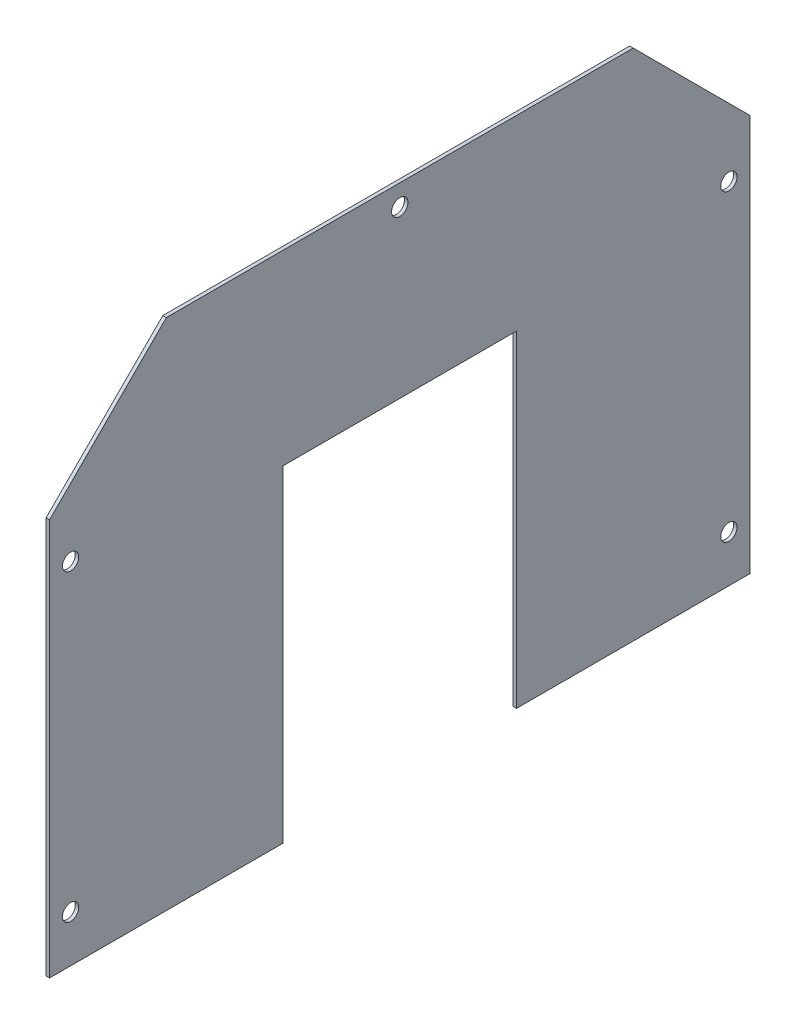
ISO-10303-21;
HEADER;
FILE_DESCRIPTION(('STEP AP214'),'2;1');
FILE_NAME('part.step','',(''),(''),'','','');
FILE_SCHEMA(('AUTOMOTIVE_DESIGN { 1 0 10303 214 1 1 1 1 }'));
ENDSEC;
DATA;
#1=APPLICATION_CONTEXT('core data for automotive mechanical design processes');
#2=APPLICATION_PROTOCOL_DEFINITION('international standard','automotive_design',2000,#1);
#3=PRODUCT_CONTEXT('',#1,'mechanical');
#4=PRODUCT('Part','Part','',(#3));
#5=PRODUCT_RELATED_PRODUCT_CATEGORY('part','',(#4));
#6=PRODUCT_DEFINITION_FORMATION('','',#4);
#7=PRODUCT_DEFINITION_CONTEXT('part definition',#1,'design');
#8=PRODUCT_DEFINITION('design','',#6,#7);
#9=PRODUCT_DEFINITION_SHAPE('','',#8);
#10=(LENGTH_UNIT() NAMED_UNIT(*) SI_UNIT(.MILLI.,.METRE.));
#11=(NAMED_UNIT(*) PLANE_ANGLE_UNIT() SI_UNIT($,.RADIAN.));
#12=(NAMED_UNIT(*) SI_UNIT($,.STERADIAN.) SOLID_ANGLE_UNIT());
#13=UNCERTAINTY_MEASURE_WITH_UNIT(LENGTH_MEASURE(1.E-05),#10,'distance_accuracy_value','');
#14=(GEOMETRIC_REPRESENTATION_CONTEXT(3) GLOBAL_UNCERTAINTY_ASSIGNED_CONTEXT((#13)) GLOBAL_UNIT_ASSIGNED_CONTEXT((#10,
#11,#12)) REPRESENTATION_CONTEXT('',''));
#15=CARTESIAN_POINT('',(0.,0.,0.));
#16=DIRECTION('',(0.,0.,1.));
#17=DIRECTION('',(1.,0.,0.));
#18=AXIS2_PLACEMENT_3D('',#15,#16,#17);
#19=CARTESIAN_POINT('',(0.,0.,0.));
#20=DIRECTION('',(1.,0.,0.));
#21=DIRECTION('',(0.,0.,-1.));
#22=AXIS2_PLACEMENT_3D('',#19,#20,#21);
#23=PLANE('',#22);
#24=DIRECTION('',(0.,1.,0.));
#25=VECTOR('',#24,1.);
#26=CARTESIAN_POINT('',(0.,-250.,-50.));
#27=LINE('',#26,#25);
#28=CARTESIAN_POINT('',(0.,-110.,-50.));
#29=VERTEX_POINT('',#28);
#30=CARTESIAN_POINT('',(0.,30.,-50.));
#31=VERTEX_POINT('',#30);
#32=EDGE_CURVE('E97',#29,#31,#27,.T.);
#33=ORIENTED_EDGE('',*,*,#32,.T.);
#34=DIRECTION('',(0.,0.,1.));
#35=VECTOR('',#34,1.);
#36=CARTESIAN_POINT('',(0.,30.,50.));
#37=LINE('',#36,#35);
#38=CARTESIAN_POINT('',(0.,30.,50.));
#39=VERTEX_POINT('',#38);
#40=EDGE_CURVE('E363',#31,#39,#37,.T.);
#41=ORIENTED_EDGE('',*,*,#40,.T.);
#42=DIRECTION('',(0.,1.,0.));
#43=VECTOR('',#42,1.);
#44=CARTESIAN_POINT('',(0.,-250.,50.));
#45=LINE('',#44,#43);
#46=CARTESIAN_POINT('',(0.,-110.,50.));
#47=VERTEX_POINT('',#46);
#48=EDGE_CURVE('E366',#39,#47,#45,.F.);
#49=ORIENTED_EDGE('',*,*,#48,.T.);
#50=DIRECTION('',(0.,0.,1.));
#51=VECTOR('',#50,1.);
#52=CARTESIAN_POINT('',(0.,-110.,150.));
#53=LINE('',#52,#51);
#54=CARTESIAN_POINT('',(0.,-110.,150.));
#55=VERTEX_POINT('',#54);
#56=EDGE_CURVE('E371',#47,#55,#53,.T.);
#57=ORIENTED_EDGE('',*,*,#56,.T.);
#58=DIRECTION('',(0.,1.,0.));
#59=VECTOR('',#58,1.);
#60=CARTESIAN_POINT('',(0.,110.,150.));
#61=LINE('',#60,#59);
#62=CARTESIAN_POINT('',(0.,60.,150.));
#63=VERTEX_POINT('',#62);
#64=EDGE_CURVE('E378',#55,#63,#61,.T.);
#65=ORIENTED_EDGE('',*,*,#64,.T.);
#66=DIRECTION('',(0.,0.707106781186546,-0.707106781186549));
#67=VECTOR('',#66,1.);
#68=CARTESIAN_POINT('',(0.,60.,150.));
#69=LINE('',#68,#67);
#70=CARTESIAN_POINT('',(0.,110.,99.9999999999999));
#71=VERTEX_POINT('',#70);
#72=EDGE_CURVE('E382',#63,#71,#69,.T.);
#73=ORIENTED_EDGE('',*,*,#72,.T.);
#74=DIRECTION('',(0.,0.,-1.));
#75=VECTOR('',#74,1.);
#76=CARTESIAN_POINT('',(0.,110.,150.));
#77=LINE('',#76,#75);
#78=CARTESIAN_POINT('',(0.,110.,-99.9999999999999));
#79=VERTEX_POINT('',#78);
#80=EDGE_CURVE('E384',#71,#79,#77,.T.);
#81=ORIENTED_EDGE('',*,*,#80,.T.);
#82=DIRECTION('',(0.,-0.707106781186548,-0.707106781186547));
#83=VECTOR('',#82,1.);
#84=CARTESIAN_POINT('',(0.,110.,-99.9999999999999));
#85=LINE('',#84,#83);
#86=CARTESIAN_POINT('',(0.,59.9999999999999,-150.));
#87=VERTEX_POINT('',#86);
#88=EDGE_CURVE('E348',#79,#87,#85,.T.);
#89=ORIENTED_EDGE('',*,*,#88,.T.);
#90=DIRECTION('',(0.,1.,0.));
#91=VECTOR('',#90,1.);
#92=CARTESIAN_POINT('',(0.,110.,-150.));
#93=LINE('',#92,#91);
#94=CARTESIAN_POINT('',(0.,-110.,-150.));
#95=VERTEX_POINT('',#94);
#96=EDGE_CURVE('E100',#87,#95,#93,.F.);
#97=ORIENTED_EDGE('',*,*,#96,.T.);
#98=DIRECTION('',(0.,0.,1.));
#99=VECTOR('',#98,1.);
#100=CARTESIAN_POINT('',(0.,-110.,150.));
#101=LINE('',#100,#99);
#102=EDGE_CURVE('E92',#95,#29,#101,.T.);
#103=ORIENTED_EDGE('',*,*,#102,.T.);
#104=EDGE_LOOP('',(#33,#41,#49,#57,#65,#73,#81,#89,#97,#103));
#105=FACE_BOUND('',#104,.T.);
#106=CARTESIAN_POINT('',(0.,100.999999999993,2.00580293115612E-11));
#107=DIRECTION('',(1.,0.,0.));
#108=DIRECTION('',(0.,0.,-1.));
#109=AXIS2_PLACEMENT_3D('',#106,#107,#108);
#110=CIRCLE('',#109,3.5);
#111=CARTESIAN_POINT('',(0.,100.999999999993,-3.49999999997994));
#112=VERTEX_POINT('',#111);
#113=EDGE_CURVE('E110',#112,#112,#110,.T.);
#114=ORIENTED_EDGE('',*,*,#113,.T.);
#115=EDGE_LOOP('',(#114));
#116=FACE_BOUND('',#115,.T.);
#117=CARTESIAN_POINT('',(0.,39.9999999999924,-140.999999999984));
#118=DIRECTION('',(1.,0.,0.));
#119=DIRECTION('',(0.,0.,-1.));
#120=AXIS2_PLACEMENT_3D('',#117,#118,#119);
#121=CIRCLE('',#120,3.5);
#122=CARTESIAN_POINT('',(0.,39.9999999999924,-144.499999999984));
#123=VERTEX_POINT('',#122);
#124=EDGE_CURVE('E139',#123,#123,#121,.T.);
#125=ORIENTED_EDGE('',*,*,#124,.T.);
#126=EDGE_LOOP('',(#125));
#127=FACE_BOUND('',#126,.T.);
#128=CARTESIAN_POINT('',(0.,-90.0000000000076,-140.999999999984));
#129=DIRECTION('',(1.,0.,0.));
#130=DIRECTION('',(0.,0.,-1.));
#131=AXIS2_PLACEMENT_3D('',#128,#129,#130);
#132=CIRCLE('',#131,3.5);
#133=CARTESIAN_POINT('',(0.,-90.0000000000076,-144.499999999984));
#134=VERTEX_POINT('',#133);
#135=EDGE_CURVE('E142',#134,#134,#132,.T.);
#136=ORIENTED_EDGE('',*,*,#135,.T.);
#137=EDGE_LOOP('',(#136));
#138=FACE_BOUND('',#137,.T.);
#139=CARTESIAN_POINT('',(0.,-90.0000000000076,141.000000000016));
#140=DIRECTION('',(1.,0.,0.));
#141=DIRECTION('',(0.,0.,-1.));
#142=AXIS2_PLACEMENT_3D('',#139,#140,#141);
#143=CIRCLE('',#142,3.5);
#144=CARTESIAN_POINT('',(0.,-90.0000000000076,137.500000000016));
#145=VERTEX_POINT('',#144);
#146=EDGE_CURVE('E144',#145,#145,#143,.T.);
#147=ORIENTED_EDGE('',*,*,#146,.T.);
#148=EDGE_LOOP('',(#147));
#149=FACE_BOUND('',#148,.T.);
#150=CARTESIAN_POINT('',(0.,39.9999999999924,141.000000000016));
#151=DIRECTION('',(1.,0.,0.));
#152=DIRECTION('',(0.,0.,-1.));
#153=AXIS2_PLACEMENT_3D('',#150,#151,#152);
#154=CIRCLE('',#153,3.5);
#155=CARTESIAN_POINT('',(0.,39.9999999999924,137.500000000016));
#156=VERTEX_POINT('',#155);
#157=EDGE_CURVE('E20',#156,#156,#154,.T.);
#158=ORIENTED_EDGE('',*,*,#157,.T.);
#159=EDGE_LOOP('',(#158));
#160=FACE_BOUND('',#159,.T.);
#161=ADVANCED_FACE('F17',(#105,#116,#127,#138,#149,#160),#23,.F.);
#162=CARTESIAN_POINT('',(0.,39.9999999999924,141.000000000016));
#163=DIRECTION('',(1.,0.,0.));
#164=DIRECTION('',(0.,0.,-1.));
#165=AXIS2_PLACEMENT_3D('',#162,#163,#164);
#166=CYLINDRICAL_SURFACE('',#165,3.5);
#167=CARTESIAN_POINT('',(1.5,39.9999999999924,141.000000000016));
#168=DIRECTION('',(1.,0.,0.));
#169=DIRECTION('',(0.,0.,-1.));
#170=AXIS2_PLACEMENT_3D('',#167,#168,#169);
#171=CIRCLE('',#170,3.5);
#172=CARTESIAN_POINT('',(1.5,39.9999999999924,137.500000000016));
#173=VERTEX_POINT('',#172);
#174=EDGE_CURVE('E134',#173,#173,#171,.F.);
#175=ORIENTED_EDGE('',*,*,#174,.F.);
#176=EDGE_LOOP('',(#175));
#177=FACE_BOUND('',#176,.T.);
#178=ORIENTED_EDGE('',*,*,#157,.F.);
#179=EDGE_LOOP('',(#178));
#180=FACE_BOUND('',#179,.T.);
#181=ADVANCED_FACE('F152',(#177,#180),#166,.F.);
#182=CARTESIAN_POINT('',(0.,-90.0000000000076,141.000000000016));
#183=DIRECTION('',(1.,0.,0.));
#184=DIRECTION('',(0.,0.,-1.));
#185=AXIS2_PLACEMENT_3D('',#182,#183,#184);
#186=CYLINDRICAL_SURFACE('',#185,3.5);
#187=CARTESIAN_POINT('',(1.5,-90.0000000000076,141.000000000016));
#188=DIRECTION('',(1.,0.,0.));
#189=DIRECTION('',(0.,0.,-1.));
#190=AXIS2_PLACEMENT_3D('',#187,#188,#189);
#191=CIRCLE('',#190,3.5);
#192=CARTESIAN_POINT('',(1.5,-90.0000000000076,137.500000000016));
#193=VERTEX_POINT('',#192);
#194=EDGE_CURVE('E131',#193,#193,#191,.F.);
#195=ORIENTED_EDGE('',*,*,#194,.F.);
#196=EDGE_LOOP('',(#195));
#197=FACE_BOUND('',#196,.T.);
#198=ORIENTED_EDGE('',*,*,#146,.F.);
#199=EDGE_LOOP('',(#198));
#200=FACE_BOUND('',#199,.T.);
#201=ADVANCED_FACE('F154',(#197,#200),#186,.F.);
#202=CARTESIAN_POINT('',(0.,-90.0000000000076,-140.999999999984));
#203=DIRECTION('',(1.,0.,0.));
#204=DIRECTION('',(0.,0.,-1.));
#205=AXIS2_PLACEMENT_3D('',#202,#203,#204);
#206=CYLINDRICAL_SURFACE('',#205,3.5);
#207=CARTESIAN_POINT('',(1.5,-90.0000000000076,-140.999999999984));
#208=DIRECTION('',(1.,0.,0.));
#209=DIRECTION('',(0.,0.,-1.));
#210=AXIS2_PLACEMENT_3D('',#207,#208,#209);
#211=CIRCLE('',#210,3.5);
#212=CARTESIAN_POINT('',(1.5,-90.0000000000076,-144.499999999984));
#213=VERTEX_POINT('',#212);
#214=EDGE_CURVE('E128',#213,#213,#211,.F.);
#215=ORIENTED_EDGE('',*,*,#214,.F.);
#216=EDGE_LOOP('',(#215));
#217=FACE_BOUND('',#216,.T.);
#218=ORIENTED_EDGE('',*,*,#135,.F.);
#219=EDGE_LOOP('',(#218));
#220=FACE_BOUND('',#219,.T.);
#221=ADVANCED_FACE('F161',(#217,#220),#206,.F.);
#222=CARTESIAN_POINT('',(0.,39.9999999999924,-140.999999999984));
#223=DIRECTION('',(1.,0.,0.));
#224=DIRECTION('',(0.,0.,-1.));
#225=AXIS2_PLACEMENT_3D('',#222,#223,#224);
#226=CYLINDRICAL_SURFACE('',#225,3.5);
#227=CARTESIAN_POINT('',(1.5,39.9999999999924,-140.999999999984));
#228=DIRECTION('',(1.,0.,0.));
#229=DIRECTION('',(0.,0.,-1.));
#230=AXIS2_PLACEMENT_3D('',#227,#228,#229);
#231=CIRCLE('',#230,3.5);
#232=CARTESIAN_POINT('',(1.5,39.9999999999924,-144.499999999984));
#233=VERTEX_POINT('',#232);
#234=EDGE_CURVE('E125',#233,#233,#231,.F.);
#235=ORIENTED_EDGE('',*,*,#234,.F.);
#236=EDGE_LOOP('',(#235));
#237=FACE_BOUND('',#236,.T.);
#238=ORIENTED_EDGE('',*,*,#124,.F.);
#239=EDGE_LOOP('',(#238));
#240=FACE_BOUND('',#239,.T.);
#241=ADVANCED_FACE('F212',(#237,#240),#226,.F.);
#242=CARTESIAN_POINT('',(0.,100.999999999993,2.00580293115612E-11));
#243=DIRECTION('',(1.,0.,0.));
#244=DIRECTION('',(0.,0.,-1.));
#245=AXIS2_PLACEMENT_3D('',#242,#243,#244);
#246=CYLINDRICAL_SURFACE('',#245,3.5);
#247=CARTESIAN_POINT('',(1.5,100.999999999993,2.00580293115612E-11));
#248=DIRECTION('',(1.,0.,0.));
#249=DIRECTION('',(0.,0.,-1.));
#250=AXIS2_PLACEMENT_3D('',#247,#248,#249);
#251=CIRCLE('',#250,3.5);
#252=CARTESIAN_POINT('',(1.5,100.999999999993,-3.49999999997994));
#253=VERTEX_POINT('',#252);
#254=EDGE_CURVE('E121',#253,#253,#251,.F.);
#255=ORIENTED_EDGE('',*,*,#254,.F.);
#256=EDGE_LOOP('',(#255));
#257=FACE_BOUND('',#256,.T.);
#258=ORIENTED_EDGE('',*,*,#113,.F.);
#259=EDGE_LOOP('',(#258));
#260=FACE_BOUND('',#259,.T.);
#261=ADVANCED_FACE('F209',(#257,#260),#246,.F.);
#262=CARTESIAN_POINT('',(0.,-250.,-50.));
#263=DIRECTION('',(0.,0.,-1.));
#264=DIRECTION('',(-1.,0.,0.));
#265=AXIS2_PLACEMENT_3D('',#262,#263,#264);
#266=PLANE('',#265);
#267=DIRECTION('',(1.,0.,0.));
#268=VECTOR('',#267,1.);
#269=CARTESIAN_POINT('',(0.,30.,-50.));
#270=LINE('',#269,#268);
#271=CARTESIAN_POINT('',(1.5,30.,-50.));
#272=VERTEX_POINT('',#271);
#273=EDGE_CURVE('E108',#272,#31,#270,.F.);
#274=ORIENTED_EDGE('',*,*,#273,.T.);
#275=ORIENTED_EDGE('',*,*,#32,.F.);
#276=DIRECTION('',(1.,0.,0.));
#277=VECTOR('',#276,1.);
#278=CARTESIAN_POINT('',(1.5,-110.,-50.));
#279=LINE('',#278,#277);
#280=CARTESIAN_POINT('',(1.5,-110.,-50.));
#281=VERTEX_POINT('',#280);
#282=EDGE_CURVE('E102',#29,#281,#279,.T.);
#283=ORIENTED_EDGE('',*,*,#282,.T.);
#284=DIRECTION('',(0.,1.,0.));
#285=VECTOR('',#284,1.);
#286=CARTESIAN_POINT('',(1.5,0.,-50.));
#287=LINE('',#286,#285);
#288=EDGE_CURVE('E124',#272,#281,#287,.F.);
#289=ORIENTED_EDGE('',*,*,#288,.F.);
#290=EDGE_LOOP('',(#274,#275,#283,#289));
#291=FACE_BOUND('',#290,.T.);
#292=ADVANCED_FACE('F105',(#291),#266,.F.);
#293=CARTESIAN_POINT('',(1.5,-110.,150.));
#294=DIRECTION('',(0.,1.,0.));
#295=DIRECTION('',(0.,0.,1.));
#296=AXIS2_PLACEMENT_3D('',#293,#294,#295);
#297=PLANE('',#296);
#298=ORIENTED_EDGE('',*,*,#282,.F.);
#299=ORIENTED_EDGE('',*,*,#102,.F.);
#300=DIRECTION('',(1.,0.,0.));
#301=VECTOR('',#300,1.);
#302=CARTESIAN_POINT('',(1.5,-110.,-150.));
#303=LINE('',#302,#301);
#304=CARTESIAN_POINT('',(1.5,-110.,-150.));
#305=VERTEX_POINT('',#304);
#306=EDGE_CURVE('E116',#95,#305,#303,.T.);
#307=ORIENTED_EDGE('',*,*,#306,.T.);
#308=DIRECTION('',(0.,0.,-1.));
#309=VECTOR('',#308,1.);
#310=CARTESIAN_POINT('',(1.5,-110.,0.));
#311=LINE('',#310,#309);
#312=EDGE_CURVE('E114',#281,#305,#311,.T.);
#313=ORIENTED_EDGE('',*,*,#312,.F.);
#314=EDGE_LOOP('',(#298,#299,#307,#313));
#315=FACE_BOUND('',#314,.T.);
#316=ADVANCED_FACE('F112',(#315),#297,.F.);
#317=CARTESIAN_POINT('',(1.5,110.,-150.));
#318=DIRECTION('',(0.,0.,1.));
#319=DIRECTION('',(1.,0.,0.));
#320=AXIS2_PLACEMENT_3D('',#317,#318,#319);
#321=PLANE('',#320);
#322=DIRECTION('',(1.,0.,0.));
#323=VECTOR('',#322,1.);
#324=CARTESIAN_POINT('',(1.5,59.9999999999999,-150.));
#325=LINE('',#324,#323);
#326=CARTESIAN_POINT('',(1.5,59.9999999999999,-150.));
#327=VERTEX_POINT('',#326);
#328=EDGE_CURVE('E343',#87,#327,#325,.T.);
#329=ORIENTED_EDGE('',*,*,#328,.T.);
#330=DIRECTION('',(0.,1.,0.));
#331=VECTOR('',#330,1.);
#332=CARTESIAN_POINT('',(1.5,0.,-150.));
#333=LINE('',#332,#331);
#334=EDGE_CURVE('E346',#305,#327,#333,.T.);
#335=ORIENTED_EDGE('',*,*,#334,.F.);
#336=ORIENTED_EDGE('',*,*,#306,.F.);
#337=ORIENTED_EDGE('',*,*,#96,.F.);
#338=EDGE_LOOP('',(#329,#335,#336,#337));
#339=FACE_BOUND('',#338,.T.);
#340=ADVANCED_FACE('F200',(#339),#321,.F.);
#341=CARTESIAN_POINT('',(1.5,110.,-99.9999999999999));
#342=DIRECTION('',(0.,-0.707106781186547,0.707106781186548));
#343=DIRECTION('',(0.,-0.707106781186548,-0.707106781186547));
#344=AXIS2_PLACEMENT_3D('',#341,#342,#343);
#345=PLANE('',#344);
#346=ORIENTED_EDGE('',*,*,#328,.F.);
#347=ORIENTED_EDGE('',*,*,#88,.F.);
#348=DIRECTION('',(1.,0.,0.));
#349=VECTOR('',#348,1.);
#350=CARTESIAN_POINT('',(1.5,110.,-99.9999999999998));
#351=LINE('',#350,#349);
#352=CARTESIAN_POINT('',(1.5,110.,-99.9999999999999));
#353=VERTEX_POINT('',#352);
#354=EDGE_CURVE('E347',#79,#353,#351,.T.);
#355=ORIENTED_EDGE('',*,*,#354,.T.);
#356=DIRECTION('',(0.,0.707106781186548,0.707106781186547));
#357=VECTOR('',#356,1.);
#358=CARTESIAN_POINT('',(1.5,59.9999999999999,-150.));
#359=LINE('',#358,#357);
#360=EDGE_CURVE('E351',#327,#353,#359,.T.);
#361=ORIENTED_EDGE('',*,*,#360,.F.);
#362=EDGE_LOOP('',(#346,#347,#355,#361));
#363=FACE_BOUND('',#362,.T.);
#364=ADVANCED_FACE('F196',(#363),#345,.F.);
#365=CARTESIAN_POINT('',(1.5,110.,150.));
#366=DIRECTION('',(0.,-1.,0.));
#367=DIRECTION('',(0.,0.,-1.));
#368=AXIS2_PLACEMENT_3D('',#365,#366,#367);
#369=PLANE('',#368);
#370=DIRECTION('',(1.,0.,0.));
#371=VECTOR('',#370,1.);
#372=CARTESIAN_POINT('',(1.5,110.,99.9999999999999));
#373=LINE('',#372,#371);
#374=CARTESIAN_POINT('',(1.5,110.,99.9999999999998));
#375=VERTEX_POINT('',#374);
#376=EDGE_CURVE('E380',#71,#375,#373,.T.);
#377=ORIENTED_EDGE('',*,*,#376,.T.);
#378=DIRECTION('',(0.,0.,-1.));
#379=VECTOR('',#378,1.);
#380=CARTESIAN_POINT('',(1.5,110.,0.));
#381=LINE('',#380,#379);
#382=EDGE_CURVE('E355',#353,#375,#381,.F.);
#383=ORIENTED_EDGE('',*,*,#382,.F.);
#384=ORIENTED_EDGE('',*,*,#354,.F.);
#385=ORIENTED_EDGE('',*,*,#80,.F.);
#386=EDGE_LOOP('',(#377,#383,#384,#385));
#387=FACE_BOUND('',#386,.T.);
#388=ADVANCED_FACE('F192',(#387),#369,.F.);
#389=CARTESIAN_POINT('',(1.5,60.,150.));
#390=DIRECTION('',(0.,-0.707106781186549,-0.707106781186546));
#391=DIRECTION('',(0.,0.707106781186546,-0.707106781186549));
#392=AXIS2_PLACEMENT_3D('',#389,#390,#391);
#393=PLANE('',#392);
#394=ORIENTED_EDGE('',*,*,#376,.F.);
#395=ORIENTED_EDGE('',*,*,#72,.F.);
#396=DIRECTION('',(1.,0.,0.));
#397=VECTOR('',#396,1.);
#398=CARTESIAN_POINT('',(1.5,60.,150.));
#399=LINE('',#398,#397);
#400=CARTESIAN_POINT('',(1.5,60.,150.));
#401=VERTEX_POINT('',#400);
#402=EDGE_CURVE('E376',#63,#401,#399,.T.);
#403=ORIENTED_EDGE('',*,*,#402,.T.);
#404=DIRECTION('',(0.,-0.707106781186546,0.707106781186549));
#405=VECTOR('',#404,1.);
#406=CARTESIAN_POINT('',(1.5,110.,99.9999999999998));
#407=LINE('',#406,#405);
#408=EDGE_CURVE('E393',#375,#401,#407,.T.);
#409=ORIENTED_EDGE('',*,*,#408,.F.);
#410=EDGE_LOOP('',(#394,#395,#403,#409));
#411=FACE_BOUND('',#410,.T.);
#412=ADVANCED_FACE('F188',(#411),#393,.F.);
#413=CARTESIAN_POINT('',(1.5,110.,150.));
#414=DIRECTION('',(0.,0.,-1.));
#415=DIRECTION('',(0.,1.,0.));
#416=AXIS2_PLACEMENT_3D('',#413,#414,#415);
#417=PLANE('',#416);
#418=ORIENTED_EDGE('',*,*,#402,.F.);
#419=ORIENTED_EDGE('',*,*,#64,.F.);
#420=DIRECTION('',(1.,0.,0.));
#421=VECTOR('',#420,1.);
#422=CARTESIAN_POINT('',(1.5,-110.,150.));
#423=LINE('',#422,#421);
#424=CARTESIAN_POINT('',(1.5,-110.,150.));
#425=VERTEX_POINT('',#424);
#426=EDGE_CURVE('E374',#55,#425,#423,.T.);
#427=ORIENTED_EDGE('',*,*,#426,.T.);
#428=DIRECTION('',(0.,1.,0.));
#429=VECTOR('',#428,1.);
#430=CARTESIAN_POINT('',(1.5,0.,150.));
#431=LINE('',#430,#429);
#432=EDGE_CURVE('E394',#401,#425,#431,.F.);
#433=ORIENTED_EDGE('',*,*,#432,.F.);
#434=EDGE_LOOP('',(#418,#419,#427,#433));
#435=FACE_BOUND('',#434,.T.);
#436=ADVANCED_FACE('F184',(#435),#417,.F.);
#437=CARTESIAN_POINT('',(1.5,-110.,150.));
#438=DIRECTION('',(0.,1.,0.));
#439=DIRECTION('',(0.,0.,1.));
#440=AXIS2_PLACEMENT_3D('',#437,#438,#439);
#441=PLANE('',#440);
#442=DIRECTION('',(1.,0.,0.));
#443=VECTOR('',#442,1.);
#444=CARTESIAN_POINT('',(0.,-110.,50.));
#445=LINE('',#444,#443);
#446=CARTESIAN_POINT('',(1.5,-110.,50.));
#447=VERTEX_POINT('',#446);
#448=EDGE_CURVE('E369',#47,#447,#445,.T.);
#449=ORIENTED_EDGE('',*,*,#448,.T.);
#450=DIRECTION('',(0.,0.,-1.));
#451=VECTOR('',#450,1.);
#452=CARTESIAN_POINT('',(1.5,-110.,0.));
#453=LINE('',#452,#451);
#454=EDGE_CURVE('E399',#425,#447,#453,.T.);
#455=ORIENTED_EDGE('',*,*,#454,.F.);
#456=ORIENTED_EDGE('',*,*,#426,.F.);
#457=ORIENTED_EDGE('',*,*,#56,.F.);
#458=EDGE_LOOP('',(#449,#455,#456,#457));
#459=FACE_BOUND('',#458,.T.);
#460=ADVANCED_FACE('F181',(#459),#441,.F.);
#461=CARTESIAN_POINT('',(0.,-250.,50.));
#462=DIRECTION('',(0.,0.,1.));
#463=DIRECTION('',(1.,0.,0.));
#464=AXIS2_PLACEMENT_3D('',#461,#462,#463);
#465=PLANE('',#464);
#466=DIRECTION('',(1.,0.,0.));
#467=VECTOR('',#466,1.);
#468=CARTESIAN_POINT('',(0.,30.,50.));
#469=LINE('',#468,#467);
#470=CARTESIAN_POINT('',(1.5,30.,50.));
#471=VERTEX_POINT('',#470);
#472=EDGE_CURVE('E35',#39,#471,#469,.T.);
#473=ORIENTED_EDGE('',*,*,#472,.T.);
#474=DIRECTION('',(0.,1.,0.));
#475=VECTOR('',#474,1.);
#476=CARTESIAN_POINT('',(1.5,0.,50.));
#477=LINE('',#476,#475);
#478=EDGE_CURVE('E26',#447,#471,#477,.T.);
#479=ORIENTED_EDGE('',*,*,#478,.F.);
#480=ORIENTED_EDGE('',*,*,#448,.F.);
#481=ORIENTED_EDGE('',*,*,#48,.F.);
#482=EDGE_LOOP('',(#473,#479,#480,#481));
#483=FACE_BOUND('',#482,.T.);
#484=ADVANCED_FACE('F173',(#483),#465,.F.);
#485=CARTESIAN_POINT('',(0.,30.,50.));
#486=DIRECTION('',(0.,1.,0.));
#487=DIRECTION('',(0.,0.,1.));
#488=AXIS2_PLACEMENT_3D('',#485,#486,#487);
#489=PLANE('',#488);
#490=ORIENTED_EDGE('',*,*,#472,.F.);
#491=ORIENTED_EDGE('',*,*,#40,.F.);
#492=ORIENTED_EDGE('',*,*,#273,.F.);
#493=DIRECTION('',(0.,0.,-1.));
#494=VECTOR('',#493,1.);
#495=CARTESIAN_POINT('',(1.5,30.,0.));
#496=LINE('',#495,#494);
#497=EDGE_CURVE('E11',#471,#272,#496,.T.);
#498=ORIENTED_EDGE('',*,*,#497,.F.);
#499=EDGE_LOOP('',(#490,#491,#492,#498));
#500=FACE_BOUND('',#499,.T.);
#501=ADVANCED_FACE('F167',(#500),#489,.F.);
#502=CARTESIAN_POINT('',(1.5,0.,0.));
#503=DIRECTION('',(1.,0.,0.));
#504=DIRECTION('',(0.,0.,-1.));
#505=AXIS2_PLACEMENT_3D('',#502,#503,#504);
#506=PLANE('',#505);
#507=ORIENTED_EDGE('',*,*,#478,.T.);
#508=ORIENTED_EDGE('',*,*,#497,.T.);
#509=ORIENTED_EDGE('',*,*,#288,.T.);
#510=ORIENTED_EDGE('',*,*,#312,.T.);
#511=ORIENTED_EDGE('',*,*,#334,.T.);
#512=ORIENTED_EDGE('',*,*,#360,.T.);
#513=ORIENTED_EDGE('',*,*,#382,.T.);
#514=ORIENTED_EDGE('',*,*,#408,.T.);
#515=ORIENTED_EDGE('',*,*,#432,.T.);
#516=ORIENTED_EDGE('',*,*,#454,.T.);
#517=EDGE_LOOP('',(#507,#508,#509,#510,#511,#512,#513,#514,#515,#516));
#518=FACE_BOUND('',#517,.T.);
#519=ORIENTED_EDGE('',*,*,#254,.T.);
#520=EDGE_LOOP('',(#519));
#521=FACE_BOUND('',#520,.T.);
#522=ORIENTED_EDGE('',*,*,#234,.T.);
#523=EDGE_LOOP('',(#522));
#524=FACE_BOUND('',#523,.T.);
#525=ORIENTED_EDGE('',*,*,#214,.T.);
#526=EDGE_LOOP('',(#525));
#527=FACE_BOUND('',#526,.T.);
#528=ORIENTED_EDGE('',*,*,#194,.T.);
#529=EDGE_LOOP('',(#528));
#530=FACE_BOUND('',#529,.T.);
#531=ORIENTED_EDGE('',*,*,#174,.T.);
#532=EDGE_LOOP('',(#531));
#533=FACE_BOUND('',#532,.T.);
#534=ADVANCED_FACE('F165',(#518,#521,#524,#527,#530,#533),#506,.T.);
#535=CLOSED_SHELL('',(#161,#181,#201,#221,#241,#261,#292,#316,#340,#364,#388,#412,#436,#460,
#484,#501,#534));
#536=MANIFOLD_SOLID_BREP('B1',#535);
#537=ADVANCED_BREP_SHAPE_REPRESENTATION('',(#18,#536),#14);
#538=SHAPE_DEFINITION_REPRESENTATION(#9,#537);
ENDSEC;
END-ISO-10303-21;
